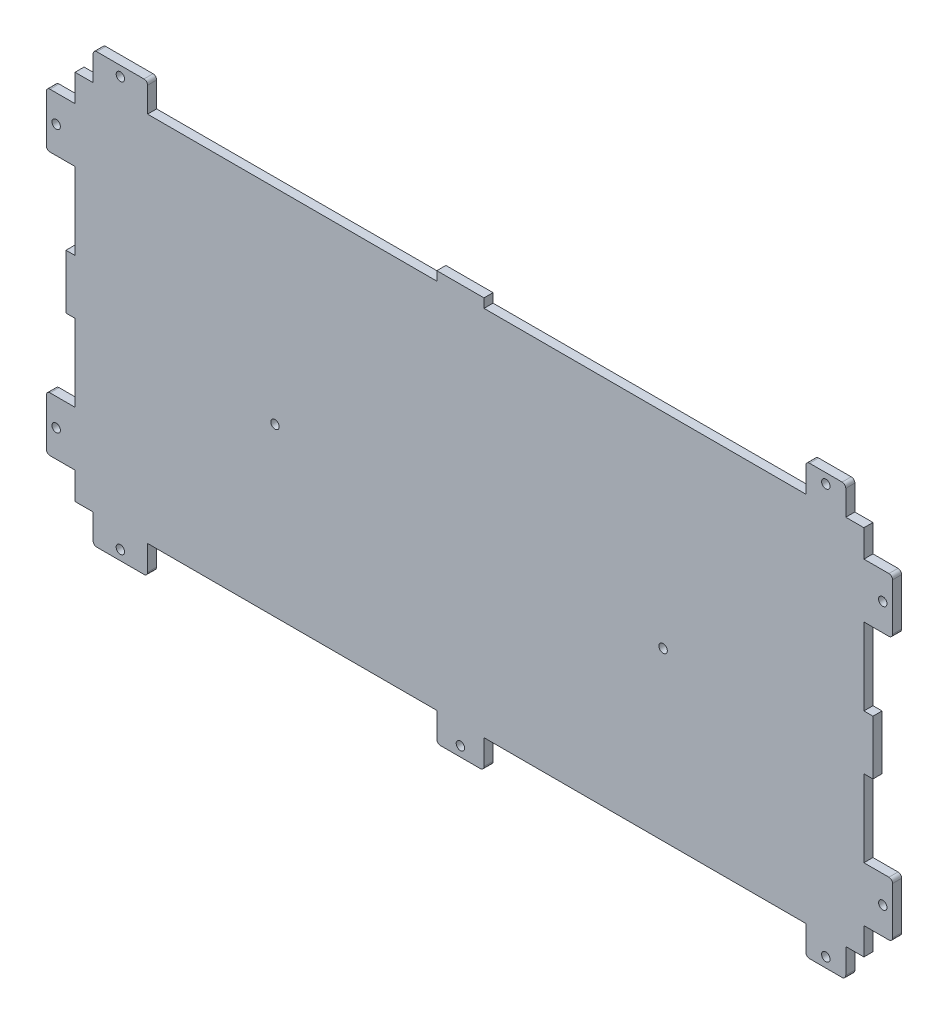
from build123d import *

# Parameters (mm, degrees)
SKETCH1_W                 = 276.225
SKETCH1_H                 = 130.175
BOSS_EXTRUDE1_DEPTH       = 3.175
SKETCH2_W                 = 16.51
SKETCH2_H                 = 3.175
SKETCH2_W_2               = 10.033
SKETCH2_H_2               = 19.05
SKETCH2_W_3               = 3.175
SKETCH2_W_4               = 19.05
SKETCH2_H_3               = 10.033
SKETCH2_W_5               = 13.97
BOSS_EXTRUDE2_DEPTH       = 3.175
F_4_CLEARANCE_HOLE1_D     = 2.9464
F_4_CLEARANCE_HOLE1_DEPTH = 3.302
FILLET1_R                 = 1.27


with BuildPart() as part:
    # Sketch1 → Boss-Extrude1 (new body)
    with BuildSketch(Plane.XY):
        with Locations((138.1125, 65.0875)):
            Rectangle(SKETCH1_W, SKETCH1_H)
    extrude(amount=BOSS_EXTRUDE1_DEPTH)

    # Sketch2 → Boss-Extrude2 (add)
    with BuildSketch(Plane.XY):
        with Locations((134.9375, 131.7625)):
            Rectangle(SKETCH2_W, SKETCH2_H)
        with Locations((281.2415, 19.05)):
            Rectangle(SKETCH2_W_2, SKETCH2_H_2)
        with Locations((281.2415, 111.125)):
            Rectangle(SKETCH2_W_2, SKETCH2_H_2)
        with Locations((277.8125, 65.0875)):
            Rectangle(SKETCH2_W_3, SKETCH2_H_2)
        with Locations((-5.0165, 19.05)):
            Rectangle(SKETCH2_W_2, SKETCH2_H_2)
        with Locations((-1.5875, 65.0875)):
            Rectangle(SKETCH2_W_3, SKETCH2_H_2)
        with Locations((-5.0165, 111.125)):
            Rectangle(SKETCH2_W_2, SKETCH2_H_2)
        with Locations((15.875, -5.0165)):
            Rectangle(SKETCH2_W_4, SKETCH2_H_3)
        with Locations((134.9375, -5.0165)):
            Rectangle(SKETCH2_W, SKETCH2_H_3)
        with Locations((262.89, -5.0165)):
            Rectangle(SKETCH2_W_5, SKETCH2_H_3)
        with Locations((15.875, 135.1915)):
            Rectangle(SKETCH2_W_4, SKETCH2_H_3)
        with Locations((262.89, 135.1915)):
            Rectangle(SKETCH2_W_5, SKETCH2_H_3)
    extrude(amount=BOSS_EXTRUDE2_DEPTH)

    # 4 Clearance Hole1
    with Locations(Plane.XY.offset(3.175)):
        with Locations((70.013924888, 58.42), (205.903924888, 58.42), (134.9375, -6.604), (15.875, -6.604), (262.89, -6.604), (262.89, 136.779), (15.875, 136.779), (282.829, 111.125), (282.829, 19.05), (-6.604, 111.125), (-6.604, 19.05)):
            Hole(F_4_CLEARANCE_HOLE1_D / 2, depth=F_4_CLEARANCE_HOLE1_DEPTH)

    # Fillet1
    fillet1_edges = [part.edges().sort_by_distance(p)[0] for p in [
        (6.35, 140.208, 1.5875),
        (25.4, 140.208, 1.5875),
        (255.905, 140.208, 1.5875),
        (269.875, 140.208, 1.5875),
        (269.875, -10.033, 1.5875),
        (255.905, -10.033, 1.5875),
        (143.1925, -10.033, 1.5875),
        (126.6825, -10.033, 1.5875),
        (25.4, -10.033, 1.5875),
        (6.35, -10.033, 1.5875),
        (-10.033, 120.65, 1.5875),
        (-10.033, 28.575, 1.5875),
        (-10.033, 101.6, 1.5875),
        (-10.033, 9.525, 1.5875),
        (286.258, 120.65, 1.5875),
        (286.258, 101.6, 1.5875),
        (286.258, 28.575, 1.5875),
        (286.258, 9.525, 1.5875),
    ]]
    fillet(fillet1_edges, radius=FILLET1_R)


solid = part.part
